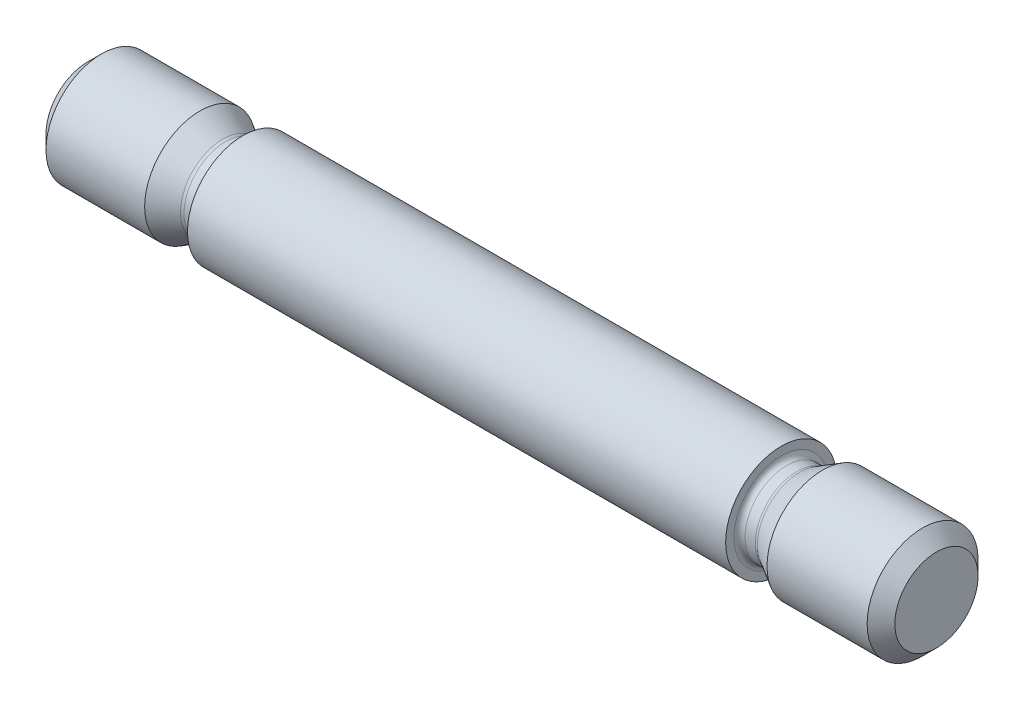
from build123d import *


with BuildPart() as part:
    # BodySke → BaseBody (revolve)
    with BuildSketch(Plane.XY, mode=Mode.PRIVATE) as basebody_sk:
        with BuildLine():
            Line((19.5, 6.107179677), (16.221539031, 8))
            Line((16.221539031, 8), (2, 8))
            Line((2, 8), (0, 6))
            Line((0, 6), (0, 0))
            Line((0, 0), (122.4, 0))
            Line((122.4, 0), (122.4, 6))
            Line((122.4, 6), (120.4, 8))
            Line((120.4, 8), (105.964101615, 8))
            Line((105.964101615, 8), (102.685640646, 6.107179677))
            ThreePointArc((102.685640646, 6.107179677), (102.492695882, 6.027259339), (102.285640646, 6))
            Line((102.285640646, 6), (100.8, 6))
            ThreePointArc((100.8, 6), (100.234314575, 6.234314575), (100, 6.8))
            Line((100, 6.8), (100, 8))
            Line((100, 8), (22.4, 8))
            Line((22.4, 8), (22.4, 6.8))
            ThreePointArc((22.4, 6.8), (22.165685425, 6.234314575), (21.6, 6))
            Line((21.6, 6), (19.9, 6))
            ThreePointArc((19.9, 6), (19.692944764, 6.027259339), (19.5, 6.107179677))
        make_face()
    revolve(basebody_sk.sketch.rotate(Axis((-3.175, 0, 0), (1, 0, 0)), 90), axis=Axis((-3.175, 0, 0), (1, 0, 0)))


solid = part.part
